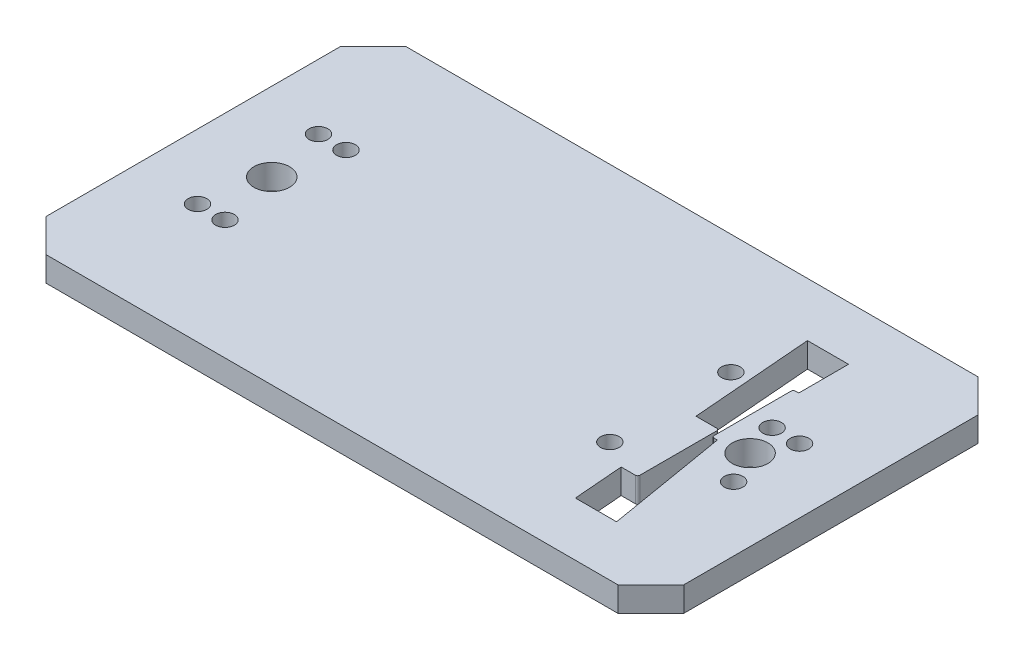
ISO-10303-21;
HEADER;
FILE_DESCRIPTION(('STEP AP214'),'2;1');
FILE_NAME('part.step','',(''),(''),'','','');
FILE_SCHEMA(('AUTOMOTIVE_DESIGN { 1 0 10303 214 1 1 1 1 }'));
ENDSEC;
DATA;
#1=APPLICATION_CONTEXT('core data for automotive mechanical design processes');
#2=APPLICATION_PROTOCOL_DEFINITION('international standard','automotive_design',2000,#1);
#3=PRODUCT_CONTEXT('',#1,'mechanical');
#4=PRODUCT('Part','Part','',(#3));
#5=PRODUCT_RELATED_PRODUCT_CATEGORY('part','',(#4));
#6=PRODUCT_DEFINITION_FORMATION('','',#4);
#7=PRODUCT_DEFINITION_CONTEXT('part definition',#1,'design');
#8=PRODUCT_DEFINITION('design','',#6,#7);
#9=PRODUCT_DEFINITION_SHAPE('','',#8);
#10=(LENGTH_UNIT() NAMED_UNIT(*) SI_UNIT(.MILLI.,.METRE.));
#11=(NAMED_UNIT(*) PLANE_ANGLE_UNIT() SI_UNIT($,.RADIAN.));
#12=(NAMED_UNIT(*) SI_UNIT($,.STERADIAN.) SOLID_ANGLE_UNIT());
#13=UNCERTAINTY_MEASURE_WITH_UNIT(LENGTH_MEASURE(1.E-05),#10,'distance_accuracy_value','');
#14=(GEOMETRIC_REPRESENTATION_CONTEXT(3) GLOBAL_UNCERTAINTY_ASSIGNED_CONTEXT((#13)) GLOBAL_UNIT_ASSIGNED_CONTEXT((#10,
#11,#12)) REPRESENTATION_CONTEXT('',''));
#15=CARTESIAN_POINT('',(0.,0.,0.));
#16=DIRECTION('',(0.,0.,1.));
#17=DIRECTION('',(1.,0.,0.));
#18=AXIS2_PLACEMENT_3D('',#15,#16,#17);
#19=CARTESIAN_POINT('',(0.,4.5,0.));
#20=DIRECTION('',(0.,1.,0.));
#21=DIRECTION('',(0.,0.,1.));
#22=AXIS2_PLACEMENT_3D('',#19,#20,#21);
#23=PLANE('',#22);
#24=CARTESIAN_POINT('',(51.3,4.5,-6.00000000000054));
#25=DIRECTION('',(0.,1.,0.));
#26=DIRECTION('',(0.,0.,1.));
#27=AXIS2_PLACEMENT_3D('',#24,#25,#26);
#28=CIRCLE('',#27,1.7);
#29=CARTESIAN_POINT('',(51.3,4.5,-4.30000000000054));
#30=VERTEX_POINT('',#29);
#31=EDGE_CURVE('E553',#30,#30,#28,.T.);
#32=ORIENTED_EDGE('',*,*,#31,.F.);
#33=EDGE_LOOP('',(#32));
#34=FACE_BOUND('',#33,.T.);
#35=CARTESIAN_POINT('',(33.8,4.5,10.9999999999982));
#36=DIRECTION('',(0.,1.,0.));
#37=DIRECTION('',(0.,0.,1.));
#38=AXIS2_PLACEMENT_3D('',#35,#36,#37);
#39=CIRCLE('',#38,1.7);
#40=CARTESIAN_POINT('',(33.8,4.5,12.6999999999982));
#41=VERTEX_POINT('',#40);
#42=EDGE_CURVE('E565',#41,#41,#39,.T.);
#43=ORIENTED_EDGE('',*,*,#42,.F.);
#44=EDGE_LOOP('',(#43));
#45=FACE_BOUND('',#44,.T.);
#46=CARTESIAN_POINT('',(-36.2,4.5,10.9999999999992));
#47=DIRECTION('',(0.,1.,0.));
#48=DIRECTION('',(0.,0.,1.));
#49=AXIS2_PLACEMENT_3D('',#46,#47,#48);
#50=CIRCLE('',#49,1.7);
#51=CARTESIAN_POINT('',(-36.2,4.5,12.6999999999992));
#52=VERTEX_POINT('',#51);
#53=EDGE_CURVE('E577',#52,#52,#50,.T.);
#54=ORIENTED_EDGE('',*,*,#53,.F.);
#55=EDGE_LOOP('',(#54));
#56=FACE_BOUND('',#55,.T.);
#57=CARTESIAN_POINT('',(-41.2,4.5,10.9999999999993));
#58=DIRECTION('',(0.,1.,0.));
#59=DIRECTION('',(0.,0.,1.));
#60=AXIS2_PLACEMENT_3D('',#57,#58,#59);
#61=CIRCLE('',#60,1.7);
#62=CARTESIAN_POINT('',(-41.2,4.5,12.6999999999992));
#63=VERTEX_POINT('',#62);
#64=EDGE_CURVE('E589',#63,#63,#61,.T.);
#65=ORIENTED_EDGE('',*,*,#64,.F.);
#66=EDGE_LOOP('',(#65));
#67=FACE_BOUND('',#66,.T.);
#68=CARTESIAN_POINT('',(48.3,4.5,0.));
#69=DIRECTION('',(0.,1.,0.));
#70=DIRECTION('',(0.,0.,1.));
#71=AXIS2_PLACEMENT_3D('',#68,#69,#70);
#72=CIRCLE('',#71,3.25);
#73=CARTESIAN_POINT('',(48.3,4.5,3.24999999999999));
#74=VERTEX_POINT('',#73);
#75=EDGE_CURVE('E601',#74,#74,#72,.T.);
#76=ORIENTED_EDGE('',*,*,#75,.F.);
#77=EDGE_LOOP('',(#76));
#78=FACE_BOUND('',#77,.T.);
#79=DIRECTION('',(-0.166195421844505,0.,-0.986092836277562));
#80=VECTOR('',#79,1.);
#81=CARTESIAN_POINT('',(43.25,4.5,0.899999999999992));
#82=LINE('',#81,#80);
#83=CARTESIAN_POINT('',(46.9662921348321,4.5,22.9500000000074));
#84=VERTEX_POINT('',#83);
#85=CARTESIAN_POINT('',(43.25,4.5,0.899999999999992));
#86=VERTEX_POINT('',#85);
#87=EDGE_CURVE('E202',#84,#86,#82,.T.);
#88=ORIENTED_EDGE('',*,*,#87,.F.);
#89=DIRECTION('',(1.,0.,0.));
#90=VECTOR('',#89,1.);
#91=CARTESIAN_POINT('',(46.9662921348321,4.5,22.9500000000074));
#92=LINE('',#91,#90);
#93=CARTESIAN_POINT('',(39.4842462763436,4.5,22.9500000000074));
#94=VERTEX_POINT('',#93);
#95=EDGE_CURVE('E194',#94,#84,#92,.T.);
#96=ORIENTED_EDGE('',*,*,#95,.F.);
#97=DIRECTION('',(0.0803714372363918,0.,0.996764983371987));
#98=VECTOR('',#97,1.);
#99=CARTESIAN_POINT('',(39.4842462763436,4.5,22.9500000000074));
#100=LINE('',#99,#98);
#101=CARTESIAN_POINT('',(38.7545241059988,4.5,13.9));
#102=VERTEX_POINT('',#101);
#103=EDGE_CURVE('E245',#102,#94,#100,.T.);
#104=ORIENTED_EDGE('',*,*,#103,.F.);
#105=DIRECTION('',(-1.,0.,0.));
#106=VECTOR('',#105,1.);
#107=CARTESIAN_POINT('',(38.7545241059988,4.5,13.9));
#108=LINE('',#107,#106);
#109=CARTESIAN_POINT('',(41.35,4.5,13.9));
#110=VERTEX_POINT('',#109);
#111=EDGE_CURVE('E243',#110,#102,#108,.T.);
#112=ORIENTED_EDGE('',*,*,#111,.F.);
#113=CARTESIAN_POINT('',(41.35,4.5,13.5));
#114=DIRECTION('',(0.,-1.,0.));
#115=DIRECTION('',(0.,0.,-1.));
#116=AXIS2_PLACEMENT_3D('',#113,#114,#115);
#117=CIRCLE('',#116,0.399999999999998);
#118=CARTESIAN_POINT('',(41.75,4.5,13.5));
#119=VERTEX_POINT('',#118);
#120=EDGE_CURVE('E241',#119,#110,#117,.T.);
#121=ORIENTED_EDGE('',*,*,#120,.F.);
#122=DIRECTION('',(0.,0.,1.));
#123=VECTOR('',#122,1.);
#124=CARTESIAN_POINT('',(41.75,4.5,13.5));
#125=LINE('',#124,#123);
#126=CARTESIAN_POINT('',(41.75,4.5,-0.500000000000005));
#127=VERTEX_POINT('',#126);
#128=EDGE_CURVE('E239',#127,#119,#125,.T.);
#129=ORIENTED_EDGE('',*,*,#128,.F.);
#130=CARTESIAN_POINT('',(41.35,4.5,-0.500000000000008));
#131=DIRECTION('',(0.,-1.,0.));
#132=DIRECTION('',(0.,0.,-1.));
#133=AXIS2_PLACEMENT_3D('',#130,#131,#132);
#134=CIRCLE('',#133,0.399999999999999);
#135=CARTESIAN_POINT('',(41.35,4.5,-0.900000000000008));
#136=VERTEX_POINT('',#135);
#137=EDGE_CURVE('E237',#136,#127,#134,.T.);
#138=ORIENTED_EDGE('',*,*,#137,.F.);
#139=DIRECTION('',(1.,0.,0.));
#140=VECTOR('',#139,1.);
#141=CARTESIAN_POINT('',(41.35,4.5,-0.900000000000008));
#142=LINE('',#141,#140);
#143=CARTESIAN_POINT('',(37.5611663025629,4.5,-0.900000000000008));
#144=VERTEX_POINT('',#143);
#145=EDGE_CURVE('E235',#144,#136,#142,.T.);
#146=ORIENTED_EDGE('',*,*,#145,.F.);
#147=DIRECTION('',(0.0803714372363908,0.,0.996764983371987));
#148=VECTOR('',#147,1.);
#149=CARTESIAN_POINT('',(37.5611663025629,4.5,-0.900000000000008));
#150=LINE('',#149,#148);
#151=CARTESIAN_POINT('',(35.7832244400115,4.5,-22.95));
#152=VERTEX_POINT('',#151);
#153=EDGE_CURVE('E233',#152,#144,#150,.T.);
#154=ORIENTED_EDGE('',*,*,#153,.F.);
#155=DIRECTION('',(-1.,0.,0.));
#156=VECTOR('',#155,1.);
#157=CARTESIAN_POINT('',(35.7832244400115,4.5,-22.95));
#158=LINE('',#157,#156);
#159=CARTESIAN_POINT('',(43.25,4.5,-22.95));
#160=VERTEX_POINT('',#159);
#161=EDGE_CURVE('E231',#160,#152,#158,.T.);
#162=ORIENTED_EDGE('',*,*,#161,.F.);
#163=DIRECTION('',(0.,0.,-1.));
#164=VECTOR('',#163,1.);
#165=CARTESIAN_POINT('',(43.25,4.5,-13.9));
#166=LINE('',#165,#164);
#167=CARTESIAN_POINT('',(43.25,4.5,-13.9));
#168=VERTEX_POINT('',#167);
#169=EDGE_CURVE('E229',#168,#160,#166,.T.);
#170=ORIENTED_EDGE('',*,*,#169,.F.);
#171=DIRECTION('',(1.,0.,0.));
#172=VECTOR('',#171,1.);
#173=CARTESIAN_POINT('',(42.65,4.5,-13.9));
#174=LINE('',#173,#172);
#175=CARTESIAN_POINT('',(42.65,4.5,-13.9));
#176=VERTEX_POINT('',#175);
#177=EDGE_CURVE('E227',#176,#168,#174,.T.);
#178=ORIENTED_EDGE('',*,*,#177,.F.);
#179=CARTESIAN_POINT('',(42.65,4.5,-13.5));
#180=DIRECTION('',(0.,-1.,0.));
#181=DIRECTION('',(0.,0.,1.));
#182=AXIS2_PLACEMENT_3D('',#179,#180,#181);
#183=CIRCLE('',#182,0.399999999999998);
#184=CARTESIAN_POINT('',(42.25,4.5,-13.5));
#185=VERTEX_POINT('',#184);
#186=EDGE_CURVE('E225',#185,#176,#183,.T.);
#187=ORIENTED_EDGE('',*,*,#186,.F.);
#188=DIRECTION('',(0.,0.,-1.));
#189=VECTOR('',#188,1.);
#190=CARTESIAN_POINT('',(42.25,4.5,0.499999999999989));
#191=LINE('',#190,#189);
#192=CARTESIAN_POINT('',(42.25,4.5,0.499999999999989));
#193=VERTEX_POINT('',#192);
#194=EDGE_CURVE('E223',#193,#185,#191,.T.);
#195=ORIENTED_EDGE('',*,*,#194,.F.);
#196=CARTESIAN_POINT('',(42.65,4.5,0.499999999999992));
#197=DIRECTION('',(0.,-1.,0.));
#198=DIRECTION('',(0.,0.,-1.));
#199=AXIS2_PLACEMENT_3D('',#196,#197,#198);
#200=CIRCLE('',#199,0.399999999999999);
#201=CARTESIAN_POINT('',(42.65,4.5,0.899999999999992));
#202=VERTEX_POINT('',#201);
#203=EDGE_CURVE('E218',#202,#193,#200,.T.);
#204=ORIENTED_EDGE('',*,*,#203,.F.);
#205=DIRECTION('',(-1.,0.,0.));
#206=VECTOR('',#205,1.);
#207=CARTESIAN_POINT('',(42.65,4.5,0.899999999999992));
#208=LINE('',#207,#206);
#209=EDGE_CURVE('E216',#86,#202,#208,.T.);
#210=ORIENTED_EDGE('',*,*,#209,.F.);
#211=EDGE_LOOP('',(#88,#96,#104,#112,#121,#129,#138,#146,#154,#162,#170,#178,#187,#195,#204,#210));
#212=FACE_BOUND('',#211,.T.);
#213=DIRECTION('',(0.,0.,1.));
#214=VECTOR('',#213,1.);
#215=CARTESIAN_POINT('',(-53.,4.5,-26.75));
#216=LINE('',#215,#214);
#217=CARTESIAN_POINT('',(-53.,4.5,-26.75));
#218=VERTEX_POINT('',#217);
#219=CARTESIAN_POINT('',(-53.,4.5,26.75));
#220=VERTEX_POINT('',#219);
#221=EDGE_CURVE('E318',#218,#220,#216,.T.);
#222=ORIENTED_EDGE('',*,*,#221,.T.);
#223=DIRECTION('',(0.707106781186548,0.,0.707106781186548));
#224=VECTOR('',#223,1.);
#225=CARTESIAN_POINT('',(-53.,4.5,26.75));
#226=LINE('',#225,#224);
#227=CARTESIAN_POINT('',(-47.,4.5,32.75));
#228=VERTEX_POINT('',#227);
#229=EDGE_CURVE('E321',#220,#228,#226,.T.);
#230=ORIENTED_EDGE('',*,*,#229,.T.);
#231=DIRECTION('',(1.,0.,0.));
#232=VECTOR('',#231,1.);
#233=CARTESIAN_POINT('',(-47.,4.5,32.75));
#234=LINE('',#233,#232);
#235=CARTESIAN_POINT('',(57.,4.5,32.75));
#236=VERTEX_POINT('',#235);
#237=EDGE_CURVE('E324',#228,#236,#234,.T.);
#238=ORIENTED_EDGE('',*,*,#237,.T.);
#239=DIRECTION('',(0.707106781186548,0.,-0.707106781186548));
#240=VECTOR('',#239,1.);
#241=CARTESIAN_POINT('',(57.,4.5,32.75));
#242=LINE('',#241,#240);
#243=CARTESIAN_POINT('',(63.,4.5,26.75));
#244=VERTEX_POINT('',#243);
#245=EDGE_CURVE('E326',#236,#244,#242,.T.);
#246=ORIENTED_EDGE('',*,*,#245,.T.);
#247=DIRECTION('',(0.,0.,-1.));
#248=VECTOR('',#247,1.);
#249=CARTESIAN_POINT('',(63.,4.5,26.75));
#250=LINE('',#249,#248);
#251=CARTESIAN_POINT('',(63.,4.5,-26.75));
#252=VERTEX_POINT('',#251);
#253=EDGE_CURVE('E328',#244,#252,#250,.T.);
#254=ORIENTED_EDGE('',*,*,#253,.T.);
#255=DIRECTION('',(-0.707106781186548,0.,-0.707106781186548));
#256=VECTOR('',#255,1.);
#257=CARTESIAN_POINT('',(63.,4.5,-26.75));
#258=LINE('',#257,#256);
#259=CARTESIAN_POINT('',(57.,4.5,-32.75));
#260=VERTEX_POINT('',#259);
#261=EDGE_CURVE('E330',#252,#260,#258,.T.);
#262=ORIENTED_EDGE('',*,*,#261,.T.);
#263=DIRECTION('',(-1.,0.,0.));
#264=VECTOR('',#263,1.);
#265=CARTESIAN_POINT('',(57.,4.5,-32.75));
#266=LINE('',#265,#264);
#267=CARTESIAN_POINT('',(-47.,4.5,-32.75));
#268=VERTEX_POINT('',#267);
#269=EDGE_CURVE('E332',#260,#268,#266,.T.);
#270=ORIENTED_EDGE('',*,*,#269,.T.);
#271=DIRECTION('',(-0.707106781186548,0.,0.707106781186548));
#272=VECTOR('',#271,1.);
#273=CARTESIAN_POINT('',(-47.,4.5,-32.75));
#274=LINE('',#273,#272);
#275=EDGE_CURVE('E334',#268,#218,#274,.T.);
#276=ORIENTED_EDGE('',*,*,#275,.T.);
#277=EDGE_LOOP('',(#222,#230,#238,#246,#254,#262,#270,#276));
#278=FACE_BOUND('',#277,.T.);
#279=CARTESIAN_POINT('',(-38.7,4.5,0.));
#280=DIRECTION('',(0.,1.,0.));
#281=DIRECTION('',(0.,0.,1.));
#282=AXIS2_PLACEMENT_3D('',#279,#280,#281);
#283=CIRCLE('',#282,3.25);
#284=CARTESIAN_POINT('',(-38.7,4.5,3.25));
#285=VERTEX_POINT('',#284);
#286=EDGE_CURVE('E248',#285,#285,#283,.T.);
#287=ORIENTED_EDGE('',*,*,#286,.F.);
#288=EDGE_LOOP('',(#287));
#289=FACE_BOUND('',#288,.T.);
#290=CARTESIAN_POINT('',(-41.2,4.5,-10.9999999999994));
#291=DIRECTION('',(0.,1.,0.));
#292=DIRECTION('',(0.,0.,1.));
#293=AXIS2_PLACEMENT_3D('',#290,#291,#292);
#294=CIRCLE('',#293,1.7);
#295=CARTESIAN_POINT('',(-41.2,4.5,-9.29999999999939));
#296=VERTEX_POINT('',#295);
#297=EDGE_CURVE('E595',#296,#296,#294,.T.);
#298=ORIENTED_EDGE('',*,*,#297,.F.);
#299=EDGE_LOOP('',(#298));
#300=FACE_BOUND('',#299,.T.);
#301=CARTESIAN_POINT('',(-36.2,4.5,-10.9999999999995));
#302=DIRECTION('',(0.,1.,0.));
#303=DIRECTION('',(0.,0.,1.));
#304=AXIS2_PLACEMENT_3D('',#301,#302,#303);
#305=CIRCLE('',#304,1.7);
#306=CARTESIAN_POINT('',(-36.2,4.5,-9.29999999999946));
#307=VERTEX_POINT('',#306);
#308=EDGE_CURVE('E583',#307,#307,#305,.T.);
#309=ORIENTED_EDGE('',*,*,#308,.F.);
#310=EDGE_LOOP('',(#309));
#311=FACE_BOUND('',#310,.T.);
#312=CARTESIAN_POINT('',(33.8,4.5,-11.0000000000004));
#313=DIRECTION('',(0.,1.,0.));
#314=DIRECTION('',(0.,0.,1.));
#315=AXIS2_PLACEMENT_3D('',#312,#313,#314);
#316=CIRCLE('',#315,1.7);
#317=CARTESIAN_POINT('',(33.8,4.5,-9.30000000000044));
#318=VERTEX_POINT('',#317);
#319=EDGE_CURVE('E571',#318,#318,#316,.T.);
#320=ORIENTED_EDGE('',*,*,#319,.F.);
#321=EDGE_LOOP('',(#320));
#322=FACE_BOUND('',#321,.T.);
#323=CARTESIAN_POINT('',(46.3,4.5,-6.00000000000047));
#324=DIRECTION('',(0.,1.,0.));
#325=DIRECTION('',(0.,0.,1.));
#326=AXIS2_PLACEMENT_3D('',#323,#324,#325);
#327=CIRCLE('',#326,1.7);
#328=CARTESIAN_POINT('',(46.3,4.5,-4.30000000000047));
#329=VERTEX_POINT('',#328);
#330=EDGE_CURVE('E559',#329,#329,#327,.T.);
#331=ORIENTED_EDGE('',*,*,#330,.F.);
#332=EDGE_LOOP('',(#331));
#333=FACE_BOUND('',#332,.T.);
#334=CARTESIAN_POINT('',(51.3,4.5,5.99999999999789));
#335=DIRECTION('',(0.,1.,0.));
#336=DIRECTION('',(0.,0.,1.));
#337=AXIS2_PLACEMENT_3D('',#334,#335,#336);
#338=CIRCLE('',#337,1.7);
#339=CARTESIAN_POINT('',(51.3,4.5,7.69999999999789));
#340=VERTEX_POINT('',#339);
#341=EDGE_CURVE('E544',#340,#340,#338,.T.);
#342=ORIENTED_EDGE('',*,*,#341,.F.);
#343=EDGE_LOOP('',(#342));
#344=FACE_BOUND('',#343,.T.);
#345=ADVANCED_FACE('F33',(#34,#45,#56,#67,#78,#212,#278,#289,#300,#311,#322,#333,#344),#23,.T.);
#346=CARTESIAN_POINT('',(0.,0.,0.));
#347=DIRECTION('',(0.,1.,0.));
#348=DIRECTION('',(0.,0.,1.));
#349=AXIS2_PLACEMENT_3D('',#346,#347,#348);
#350=PLANE('',#349);
#351=CARTESIAN_POINT('',(51.3,0.,-6.00000000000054));
#352=DIRECTION('',(0.,1.,0.));
#353=DIRECTION('',(0.,0.,1.));
#354=AXIS2_PLACEMENT_3D('',#351,#352,#353);
#355=CIRCLE('',#354,1.7);
#356=CARTESIAN_POINT('',(51.3,0.,-4.30000000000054));
#357=VERTEX_POINT('',#356);
#358=EDGE_CURVE('E550',#357,#357,#355,.T.);
#359=ORIENTED_EDGE('',*,*,#358,.T.);
#360=EDGE_LOOP('',(#359));
#361=FACE_BOUND('',#360,.T.);
#362=CARTESIAN_POINT('',(33.8,0.,10.9999999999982));
#363=DIRECTION('',(0.,1.,0.));
#364=DIRECTION('',(0.,0.,1.));
#365=AXIS2_PLACEMENT_3D('',#362,#363,#364);
#366=CIRCLE('',#365,1.7);
#367=CARTESIAN_POINT('',(33.8,0.,12.6999999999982));
#368=VERTEX_POINT('',#367);
#369=EDGE_CURVE('E562',#368,#368,#366,.T.);
#370=ORIENTED_EDGE('',*,*,#369,.T.);
#371=EDGE_LOOP('',(#370));
#372=FACE_BOUND('',#371,.T.);
#373=CARTESIAN_POINT('',(-36.2,0.,10.9999999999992));
#374=DIRECTION('',(0.,1.,0.));
#375=DIRECTION('',(0.,0.,1.));
#376=AXIS2_PLACEMENT_3D('',#373,#374,#375);
#377=CIRCLE('',#376,1.7);
#378=CARTESIAN_POINT('',(-36.2,0.,12.6999999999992));
#379=VERTEX_POINT('',#378);
#380=EDGE_CURVE('E574',#379,#379,#377,.T.);
#381=ORIENTED_EDGE('',*,*,#380,.T.);
#382=EDGE_LOOP('',(#381));
#383=FACE_BOUND('',#382,.T.);
#384=CARTESIAN_POINT('',(-41.2,0.,10.9999999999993));
#385=DIRECTION('',(0.,1.,0.));
#386=DIRECTION('',(0.,0.,1.));
#387=AXIS2_PLACEMENT_3D('',#384,#385,#386);
#388=CIRCLE('',#387,1.7);
#389=CARTESIAN_POINT('',(-41.2,0.,12.6999999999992));
#390=VERTEX_POINT('',#389);
#391=EDGE_CURVE('E586',#390,#390,#388,.T.);
#392=ORIENTED_EDGE('',*,*,#391,.T.);
#393=EDGE_LOOP('',(#392));
#394=FACE_BOUND('',#393,.T.);
#395=CARTESIAN_POINT('',(48.3,0.,0.));
#396=DIRECTION('',(0.,1.,0.));
#397=DIRECTION('',(0.,0.,1.));
#398=AXIS2_PLACEMENT_3D('',#395,#396,#397);
#399=CIRCLE('',#398,3.25);
#400=CARTESIAN_POINT('',(48.3,0.,3.24999999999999));
#401=VERTEX_POINT('',#400);
#402=EDGE_CURVE('E598',#401,#401,#399,.T.);
#403=ORIENTED_EDGE('',*,*,#402,.T.);
#404=EDGE_LOOP('',(#403));
#405=FACE_BOUND('',#404,.T.);
#406=DIRECTION('',(1.,0.,0.));
#407=VECTOR('',#406,1.);
#408=CARTESIAN_POINT('',(46.9662921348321,0.,22.9500000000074));
#409=LINE('',#408,#407);
#410=CARTESIAN_POINT('',(39.4842462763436,0.,22.9500000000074));
#411=VERTEX_POINT('',#410);
#412=CARTESIAN_POINT('',(46.9662921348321,0.,22.9500000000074));
#413=VERTEX_POINT('',#412);
#414=EDGE_CURVE('E56',#411,#413,#409,.T.);
#415=ORIENTED_EDGE('',*,*,#414,.T.);
#416=DIRECTION('',(-0.166195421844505,0.,-0.986092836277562));
#417=VECTOR('',#416,1.);
#418=CARTESIAN_POINT('',(43.25,0.,0.899999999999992));
#419=LINE('',#418,#417);
#420=CARTESIAN_POINT('',(43.25,0.,0.899999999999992));
#421=VERTEX_POINT('',#420);
#422=EDGE_CURVE('E209',#413,#421,#419,.T.);
#423=ORIENTED_EDGE('',*,*,#422,.T.);
#424=DIRECTION('',(-1.,0.,0.));
#425=VECTOR('',#424,1.);
#426=CARTESIAN_POINT('',(42.65,0.,0.899999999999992));
#427=LINE('',#426,#425);
#428=CARTESIAN_POINT('',(42.65,0.,0.899999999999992));
#429=VERTEX_POINT('',#428);
#430=EDGE_CURVE('E250',#421,#429,#427,.T.);
#431=ORIENTED_EDGE('',*,*,#430,.T.);
#432=CARTESIAN_POINT('',(42.65,0.,0.499999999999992));
#433=DIRECTION('',(0.,-1.,0.));
#434=DIRECTION('',(0.,0.,-1.));
#435=AXIS2_PLACEMENT_3D('',#432,#433,#434);
#436=CIRCLE('',#435,0.399999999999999);
#437=CARTESIAN_POINT('',(42.25,0.,0.499999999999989));
#438=VERTEX_POINT('',#437);
#439=EDGE_CURVE('E253',#429,#438,#436,.T.);
#440=ORIENTED_EDGE('',*,*,#439,.T.);
#441=DIRECTION('',(0.,0.,-1.));
#442=VECTOR('',#441,1.);
#443=CARTESIAN_POINT('',(42.25,0.,0.499999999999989));
#444=LINE('',#443,#442);
#445=CARTESIAN_POINT('',(42.25,0.,-13.5));
#446=VERTEX_POINT('',#445);
#447=EDGE_CURVE('E256',#438,#446,#444,.T.);
#448=ORIENTED_EDGE('',*,*,#447,.T.);
#449=CARTESIAN_POINT('',(42.65,0.,-13.5));
#450=DIRECTION('',(0.,-1.,0.));
#451=DIRECTION('',(0.,0.,1.));
#452=AXIS2_PLACEMENT_3D('',#449,#450,#451);
#453=CIRCLE('',#452,0.399999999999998);
#454=CARTESIAN_POINT('',(42.65,0.,-13.9));
#455=VERTEX_POINT('',#454);
#456=EDGE_CURVE('E259',#446,#455,#453,.T.);
#457=ORIENTED_EDGE('',*,*,#456,.T.);
#458=DIRECTION('',(1.,0.,0.));
#459=VECTOR('',#458,1.);
#460=CARTESIAN_POINT('',(42.65,0.,-13.9));
#461=LINE('',#460,#459);
#462=CARTESIAN_POINT('',(43.25,0.,-13.9));
#463=VERTEX_POINT('',#462);
#464=EDGE_CURVE('E262',#455,#463,#461,.T.);
#465=ORIENTED_EDGE('',*,*,#464,.T.);
#466=DIRECTION('',(0.,0.,-1.));
#467=VECTOR('',#466,1.);
#468=CARTESIAN_POINT('',(43.25,0.,-13.9));
#469=LINE('',#468,#467);
#470=CARTESIAN_POINT('',(43.25,0.,-22.95));
#471=VERTEX_POINT('',#470);
#472=EDGE_CURVE('E265',#463,#471,#469,.T.);
#473=ORIENTED_EDGE('',*,*,#472,.T.);
#474=DIRECTION('',(-1.,0.,0.));
#475=VECTOR('',#474,1.);
#476=CARTESIAN_POINT('',(35.7832244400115,0.,-22.95));
#477=LINE('',#476,#475);
#478=CARTESIAN_POINT('',(35.7832244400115,0.,-22.95));
#479=VERTEX_POINT('',#478);
#480=EDGE_CURVE('E268',#471,#479,#477,.T.);
#481=ORIENTED_EDGE('',*,*,#480,.T.);
#482=DIRECTION('',(0.0803714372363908,0.,0.996764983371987));
#483=VECTOR('',#482,1.);
#484=CARTESIAN_POINT('',(37.5611663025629,0.,-0.900000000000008));
#485=LINE('',#484,#483);
#486=CARTESIAN_POINT('',(37.5611663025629,0.,-0.900000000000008));
#487=VERTEX_POINT('',#486);
#488=EDGE_CURVE('E271',#479,#487,#485,.T.);
#489=ORIENTED_EDGE('',*,*,#488,.T.);
#490=DIRECTION('',(1.,0.,0.));
#491=VECTOR('',#490,1.);
#492=CARTESIAN_POINT('',(41.35,0.,-0.900000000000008));
#493=LINE('',#492,#491);
#494=CARTESIAN_POINT('',(41.35,0.,-0.900000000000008));
#495=VERTEX_POINT('',#494);
#496=EDGE_CURVE('E274',#487,#495,#493,.T.);
#497=ORIENTED_EDGE('',*,*,#496,.T.);
#498=CARTESIAN_POINT('',(41.35,0.,-0.500000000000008));
#499=DIRECTION('',(0.,-1.,0.));
#500=DIRECTION('',(0.,0.,-1.));
#501=AXIS2_PLACEMENT_3D('',#498,#499,#500);
#502=CIRCLE('',#501,0.399999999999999);
#503=CARTESIAN_POINT('',(41.75,0.,-0.500000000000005));
#504=VERTEX_POINT('',#503);
#505=EDGE_CURVE('E277',#495,#504,#502,.T.);
#506=ORIENTED_EDGE('',*,*,#505,.T.);
#507=DIRECTION('',(0.,0.,1.));
#508=VECTOR('',#507,1.);
#509=CARTESIAN_POINT('',(41.75,0.,13.5));
#510=LINE('',#509,#508);
#511=CARTESIAN_POINT('',(41.75,0.,13.5));
#512=VERTEX_POINT('',#511);
#513=EDGE_CURVE('E280',#504,#512,#510,.T.);
#514=ORIENTED_EDGE('',*,*,#513,.T.);
#515=CARTESIAN_POINT('',(41.35,0.,13.5));
#516=DIRECTION('',(0.,-1.,0.));
#517=DIRECTION('',(0.,0.,-1.));
#518=AXIS2_PLACEMENT_3D('',#515,#516,#517);
#519=CIRCLE('',#518,0.399999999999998);
#520=CARTESIAN_POINT('',(41.35,0.,13.9));
#521=VERTEX_POINT('',#520);
#522=EDGE_CURVE('E283',#512,#521,#519,.T.);
#523=ORIENTED_EDGE('',*,*,#522,.T.);
#524=DIRECTION('',(-1.,0.,0.));
#525=VECTOR('',#524,1.);
#526=CARTESIAN_POINT('',(38.7545241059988,0.,13.9));
#527=LINE('',#526,#525);
#528=CARTESIAN_POINT('',(38.7545241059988,0.,13.9));
#529=VERTEX_POINT('',#528);
#530=EDGE_CURVE('E286',#521,#529,#527,.T.);
#531=ORIENTED_EDGE('',*,*,#530,.T.);
#532=DIRECTION('',(0.0803714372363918,0.,0.996764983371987));
#533=VECTOR('',#532,1.);
#534=CARTESIAN_POINT('',(39.4842462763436,0.,22.9500000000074));
#535=LINE('',#534,#533);
#536=EDGE_CURVE('E203',#529,#411,#535,.T.);
#537=ORIENTED_EDGE('',*,*,#536,.T.);
#538=EDGE_LOOP('',(#415,#423,#431,#440,#448,#457,#465,#473,#481,#489,#497,#506,#514,#523,#531,#537));
#539=FACE_BOUND('',#538,.T.);
#540=DIRECTION('',(0.,0.,1.));
#541=VECTOR('',#540,1.);
#542=CARTESIAN_POINT('',(-53.,0.,-26.75));
#543=LINE('',#542,#541);
#544=CARTESIAN_POINT('',(-53.,0.,-26.75));
#545=VERTEX_POINT('',#544);
#546=CARTESIAN_POINT('',(-53.,0.,26.75));
#547=VERTEX_POINT('',#546);
#548=EDGE_CURVE('E210',#545,#547,#543,.T.);
#549=ORIENTED_EDGE('',*,*,#548,.F.);
#550=DIRECTION('',(-0.707106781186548,0.,0.707106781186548));
#551=VECTOR('',#550,1.);
#552=CARTESIAN_POINT('',(-47.,0.,-32.75));
#553=LINE('',#552,#551);
#554=CARTESIAN_POINT('',(-47.,0.,-32.75));
#555=VERTEX_POINT('',#554);
#556=EDGE_CURVE('E322',#555,#545,#553,.T.);
#557=ORIENTED_EDGE('',*,*,#556,.F.);
#558=DIRECTION('',(-1.,0.,0.));
#559=VECTOR('',#558,1.);
#560=CARTESIAN_POINT('',(57.,0.,-32.75));
#561=LINE('',#560,#559);
#562=CARTESIAN_POINT('',(57.,0.,-32.75));
#563=VERTEX_POINT('',#562);
#564=EDGE_CURVE('E349',#563,#555,#561,.T.);
#565=ORIENTED_EDGE('',*,*,#564,.F.);
#566=DIRECTION('',(-0.707106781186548,0.,-0.707106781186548));
#567=VECTOR('',#566,1.);
#568=CARTESIAN_POINT('',(63.,0.,-26.75));
#569=LINE('',#568,#567);
#570=CARTESIAN_POINT('',(63.,0.,-26.75));
#571=VERTEX_POINT('',#570);
#572=EDGE_CURVE('E347',#571,#563,#569,.T.);
#573=ORIENTED_EDGE('',*,*,#572,.F.);
#574=DIRECTION('',(0.,0.,-1.));
#575=VECTOR('',#574,1.);
#576=CARTESIAN_POINT('',(63.,0.,26.75));
#577=LINE('',#576,#575);
#578=CARTESIAN_POINT('',(63.,0.,26.75));
#579=VERTEX_POINT('',#578);
#580=EDGE_CURVE('E345',#579,#571,#577,.T.);
#581=ORIENTED_EDGE('',*,*,#580,.F.);
#582=DIRECTION('',(0.707106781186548,0.,-0.707106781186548));
#583=VECTOR('',#582,1.);
#584=CARTESIAN_POINT('',(57.,0.,32.75));
#585=LINE('',#584,#583);
#586=CARTESIAN_POINT('',(57.,0.,32.75));
#587=VERTEX_POINT('',#586);
#588=EDGE_CURVE('E343',#587,#579,#585,.T.);
#589=ORIENTED_EDGE('',*,*,#588,.F.);
#590=DIRECTION('',(1.,0.,0.));
#591=VECTOR('',#590,1.);
#592=CARTESIAN_POINT('',(-47.,0.,32.75));
#593=LINE('',#592,#591);
#594=CARTESIAN_POINT('',(-47.,0.,32.75));
#595=VERTEX_POINT('',#594);
#596=EDGE_CURVE('E341',#595,#587,#593,.T.);
#597=ORIENTED_EDGE('',*,*,#596,.F.);
#598=DIRECTION('',(0.707106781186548,0.,0.707106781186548));
#599=VECTOR('',#598,1.);
#600=CARTESIAN_POINT('',(-53.,0.,26.75));
#601=LINE('',#600,#599);
#602=EDGE_CURVE('E339',#547,#595,#601,.T.);
#603=ORIENTED_EDGE('',*,*,#602,.F.);
#604=EDGE_LOOP('',(#549,#557,#565,#573,#581,#589,#597,#603));
#605=FACE_BOUND('',#604,.T.);
#606=CARTESIAN_POINT('',(-38.7,0.,0.));
#607=DIRECTION('',(0.,1.,0.));
#608=DIRECTION('',(0.,0.,1.));
#609=AXIS2_PLACEMENT_3D('',#606,#607,#608);
#610=CIRCLE('',#609,3.25);
#611=CARTESIAN_POINT('',(-38.7,0.,3.25));
#612=VERTEX_POINT('',#611);
#613=EDGE_CURVE('E604',#612,#612,#610,.T.);
#614=ORIENTED_EDGE('',*,*,#613,.T.);
#615=EDGE_LOOP('',(#614));
#616=FACE_BOUND('',#615,.T.);
#617=CARTESIAN_POINT('',(-41.2,0.,-10.9999999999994));
#618=DIRECTION('',(0.,1.,0.));
#619=DIRECTION('',(0.,0.,1.));
#620=AXIS2_PLACEMENT_3D('',#617,#618,#619);
#621=CIRCLE('',#620,1.7);
#622=CARTESIAN_POINT('',(-41.2,0.,-9.29999999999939));
#623=VERTEX_POINT('',#622);
#624=EDGE_CURVE('E592',#623,#623,#621,.T.);
#625=ORIENTED_EDGE('',*,*,#624,.T.);
#626=EDGE_LOOP('',(#625));
#627=FACE_BOUND('',#626,.T.);
#628=CARTESIAN_POINT('',(-36.2,0.,-10.9999999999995));
#629=DIRECTION('',(0.,1.,0.));
#630=DIRECTION('',(0.,0.,1.));
#631=AXIS2_PLACEMENT_3D('',#628,#629,#630);
#632=CIRCLE('',#631,1.7);
#633=CARTESIAN_POINT('',(-36.2,0.,-9.29999999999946));
#634=VERTEX_POINT('',#633);
#635=EDGE_CURVE('E580',#634,#634,#632,.T.);
#636=ORIENTED_EDGE('',*,*,#635,.T.);
#637=EDGE_LOOP('',(#636));
#638=FACE_BOUND('',#637,.T.);
#639=CARTESIAN_POINT('',(33.8,0.,-11.0000000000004));
#640=DIRECTION('',(0.,1.,0.));
#641=DIRECTION('',(0.,0.,1.));
#642=AXIS2_PLACEMENT_3D('',#639,#640,#641);
#643=CIRCLE('',#642,1.7);
#644=CARTESIAN_POINT('',(33.8,0.,-9.30000000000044));
#645=VERTEX_POINT('',#644);
#646=EDGE_CURVE('E568',#645,#645,#643,.T.);
#647=ORIENTED_EDGE('',*,*,#646,.T.);
#648=EDGE_LOOP('',(#647));
#649=FACE_BOUND('',#648,.T.);
#650=CARTESIAN_POINT('',(46.3,0.,-6.00000000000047));
#651=DIRECTION('',(0.,1.,0.));
#652=DIRECTION('',(0.,0.,1.));
#653=AXIS2_PLACEMENT_3D('',#650,#651,#652);
#654=CIRCLE('',#653,1.7);
#655=CARTESIAN_POINT('',(46.3,0.,-4.30000000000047));
#656=VERTEX_POINT('',#655);
#657=EDGE_CURVE('E556',#656,#656,#654,.T.);
#658=ORIENTED_EDGE('',*,*,#657,.T.);
#659=EDGE_LOOP('',(#658));
#660=FACE_BOUND('',#659,.T.);
#661=CARTESIAN_POINT('',(51.3,0.,5.99999999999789));
#662=DIRECTION('',(0.,1.,0.));
#663=DIRECTION('',(0.,0.,1.));
#664=AXIS2_PLACEMENT_3D('',#661,#662,#663);
#665=CIRCLE('',#664,1.7);
#666=CARTESIAN_POINT('',(51.3,0.,7.69999999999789));
#667=VERTEX_POINT('',#666);
#668=EDGE_CURVE('E547',#667,#667,#665,.T.);
#669=ORIENTED_EDGE('',*,*,#668,.T.);
#670=EDGE_LOOP('',(#669));
#671=FACE_BOUND('',#670,.T.);
#672=ADVANCED_FACE('F379',(#361,#372,#383,#394,#405,#539,#605,#616,#627,#638,#649,#660,#671),
#350,.F.);
#673=CARTESIAN_POINT('',(-53.,4.5,-26.75));
#674=DIRECTION('',(1.,0.,0.));
#675=DIRECTION('',(0.,0.,-1.));
#676=AXIS2_PLACEMENT_3D('',#673,#674,#675);
#677=PLANE('',#676);
#678=ORIENTED_EDGE('',*,*,#548,.T.);
#679=DIRECTION('',(0.,-1.,0.));
#680=VECTOR('',#679,1.);
#681=CARTESIAN_POINT('',(-53.,4.5,26.75));
#682=LINE('',#681,#680);
#683=EDGE_CURVE('E11',#220,#547,#682,.T.);
#684=ORIENTED_EDGE('',*,*,#683,.F.);
#685=ORIENTED_EDGE('',*,*,#221,.F.);
#686=DIRECTION('',(0.,-1.,0.));
#687=VECTOR('',#686,1.);
#688=CARTESIAN_POINT('',(-53.,4.5,-26.75));
#689=LINE('',#688,#687);
#690=EDGE_CURVE('E336',#218,#545,#689,.T.);
#691=ORIENTED_EDGE('',*,*,#690,.T.);
#692=EDGE_LOOP('',(#678,#684,#685,#691));
#693=FACE_BOUND('',#692,.T.);
#694=ADVANCED_FACE('F35',(#693),#677,.F.);
#695=CARTESIAN_POINT('',(-53.,4.5,26.75));
#696=DIRECTION('',(0.707106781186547,0.,-0.707106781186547));
#697=DIRECTION('',(-0.707106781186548,0.,-0.707106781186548));
#698=AXIS2_PLACEMENT_3D('',#695,#696,#697);
#699=PLANE('',#698);
#700=ORIENTED_EDGE('',*,*,#602,.T.);
#701=DIRECTION('',(0.,-1.,0.));
#702=VECTOR('',#701,1.);
#703=CARTESIAN_POINT('',(-47.,4.5,32.75));
#704=LINE('',#703,#702);
#705=EDGE_CURVE('E41',#228,#595,#704,.T.);
#706=ORIENTED_EDGE('',*,*,#705,.F.);
#707=ORIENTED_EDGE('',*,*,#229,.F.);
#708=ORIENTED_EDGE('',*,*,#683,.T.);
#709=EDGE_LOOP('',(#700,#706,#707,#708));
#710=FACE_BOUND('',#709,.T.);
#711=ADVANCED_FACE('F396',(#710),#699,.F.);
#712=CARTESIAN_POINT('',(-47.,4.5,32.75));
#713=DIRECTION('',(0.,0.,-1.));
#714=DIRECTION('',(-1.,0.,0.));
#715=AXIS2_PLACEMENT_3D('',#712,#713,#714);
#716=PLANE('',#715);
#717=ORIENTED_EDGE('',*,*,#596,.T.);
#718=DIRECTION('',(0.,-1.,0.));
#719=VECTOR('',#718,1.);
#720=CARTESIAN_POINT('',(57.,4.5,32.75));
#721=LINE('',#720,#719);
#722=EDGE_CURVE('E366',#236,#587,#721,.T.);
#723=ORIENTED_EDGE('',*,*,#722,.F.);
#724=ORIENTED_EDGE('',*,*,#237,.F.);
#725=ORIENTED_EDGE('',*,*,#705,.T.);
#726=EDGE_LOOP('',(#717,#723,#724,#725));
#727=FACE_BOUND('',#726,.T.);
#728=ADVANCED_FACE('F373',(#727),#716,.F.);
#729=CARTESIAN_POINT('',(57.,4.5,32.75));
#730=DIRECTION('',(-0.707106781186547,0.,-0.707106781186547));
#731=DIRECTION('',(-0.707106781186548,0.,0.707106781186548));
#732=AXIS2_PLACEMENT_3D('',#729,#730,#731);
#733=PLANE('',#732);
#734=ORIENTED_EDGE('',*,*,#588,.T.);
#735=DIRECTION('',(0.,-1.,0.));
#736=VECTOR('',#735,1.);
#737=CARTESIAN_POINT('',(63.,4.5,26.75));
#738=LINE('',#737,#736);
#739=EDGE_CURVE('E363',#244,#579,#738,.T.);
#740=ORIENTED_EDGE('',*,*,#739,.F.);
#741=ORIENTED_EDGE('',*,*,#245,.F.);
#742=ORIENTED_EDGE('',*,*,#722,.T.);
#743=EDGE_LOOP('',(#734,#740,#741,#742));
#744=FACE_BOUND('',#743,.T.);
#745=ADVANCED_FACE('F385',(#744),#733,.F.);
#746=CARTESIAN_POINT('',(63.,4.5,26.75));
#747=DIRECTION('',(-1.,0.,0.));
#748=DIRECTION('',(0.,0.,1.));
#749=AXIS2_PLACEMENT_3D('',#746,#747,#748);
#750=PLANE('',#749);
#751=ORIENTED_EDGE('',*,*,#580,.T.);
#752=DIRECTION('',(0.,-1.,0.));
#753=VECTOR('',#752,1.);
#754=CARTESIAN_POINT('',(63.,4.5,-26.75));
#755=LINE('',#754,#753);
#756=EDGE_CURVE('E360',#252,#571,#755,.T.);
#757=ORIENTED_EDGE('',*,*,#756,.F.);
#758=ORIENTED_EDGE('',*,*,#253,.F.);
#759=ORIENTED_EDGE('',*,*,#739,.T.);
#760=EDGE_LOOP('',(#751,#757,#758,#759));
#761=FACE_BOUND('',#760,.T.);
#762=ADVANCED_FACE('F389',(#761),#750,.F.);
#763=CARTESIAN_POINT('',(63.,4.5,-26.75));
#764=DIRECTION('',(-0.707106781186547,0.,0.707106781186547));
#765=DIRECTION('',(0.707106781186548,0.,0.707106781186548));
#766=AXIS2_PLACEMENT_3D('',#763,#764,#765);
#767=PLANE('',#766);
#768=ORIENTED_EDGE('',*,*,#572,.T.);
#769=DIRECTION('',(0.,-1.,0.));
#770=VECTOR('',#769,1.);
#771=CARTESIAN_POINT('',(57.,4.5,-32.75));
#772=LINE('',#771,#770);
#773=EDGE_CURVE('E357',#260,#563,#772,.T.);
#774=ORIENTED_EDGE('',*,*,#773,.F.);
#775=ORIENTED_EDGE('',*,*,#261,.F.);
#776=ORIENTED_EDGE('',*,*,#756,.T.);
#777=EDGE_LOOP('',(#768,#774,#775,#776));
#778=FACE_BOUND('',#777,.T.);
#779=ADVANCED_FACE('F409',(#778),#767,.F.);
#780=CARTESIAN_POINT('',(57.,4.5,-32.75));
#781=DIRECTION('',(0.,0.,1.));
#782=DIRECTION('',(1.,0.,0.));
#783=AXIS2_PLACEMENT_3D('',#780,#781,#782);
#784=PLANE('',#783);
#785=ORIENTED_EDGE('',*,*,#564,.T.);
#786=DIRECTION('',(0.,-1.,0.));
#787=VECTOR('',#786,1.);
#788=CARTESIAN_POINT('',(-47.,4.5,-32.75));
#789=LINE('',#788,#787);
#790=EDGE_CURVE('E354',#268,#555,#789,.T.);
#791=ORIENTED_EDGE('',*,*,#790,.F.);
#792=ORIENTED_EDGE('',*,*,#269,.F.);
#793=ORIENTED_EDGE('',*,*,#773,.T.);
#794=EDGE_LOOP('',(#785,#791,#792,#793));
#795=FACE_BOUND('',#794,.T.);
#796=ADVANCED_FACE('F407',(#795),#784,.F.);
#797=CARTESIAN_POINT('',(-47.,4.5,-32.75));
#798=DIRECTION('',(0.707106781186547,0.,0.707106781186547));
#799=DIRECTION('',(0.707106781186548,0.,-0.707106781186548));
#800=AXIS2_PLACEMENT_3D('',#797,#798,#799);
#801=PLANE('',#800);
#802=ORIENTED_EDGE('',*,*,#556,.T.);
#803=ORIENTED_EDGE('',*,*,#690,.F.);
#804=ORIENTED_EDGE('',*,*,#275,.F.);
#805=ORIENTED_EDGE('',*,*,#790,.T.);
#806=EDGE_LOOP('',(#802,#803,#804,#805));
#807=FACE_BOUND('',#806,.T.);
#808=ADVANCED_FACE('F402',(#807),#801,.F.);
#809=CARTESIAN_POINT('',(46.9662921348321,4.5,22.9500000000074));
#810=DIRECTION('',(0.,0.,-1.));
#811=DIRECTION('',(-1.,0.,0.));
#812=AXIS2_PLACEMENT_3D('',#809,#810,#811);
#813=PLANE('',#812);
#814=ORIENTED_EDGE('',*,*,#414,.F.);
#815=DIRECTION('',(0.,-1.,0.));
#816=VECTOR('',#815,1.);
#817=CARTESIAN_POINT('',(39.4842462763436,4.5,22.9500000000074));
#818=LINE('',#817,#816);
#819=EDGE_CURVE('E198',#94,#411,#818,.T.);
#820=ORIENTED_EDGE('',*,*,#819,.F.);
#821=ORIENTED_EDGE('',*,*,#95,.T.);
#822=DIRECTION('',(0.,-1.,0.));
#823=VECTOR('',#822,1.);
#824=CARTESIAN_POINT('',(46.9662921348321,4.5,22.9500000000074));
#825=LINE('',#824,#823);
#826=EDGE_CURVE('E197',#84,#413,#825,.T.);
#827=ORIENTED_EDGE('',*,*,#826,.T.);
#828=EDGE_LOOP('',(#814,#820,#821,#827));
#829=FACE_BOUND('',#828,.T.);
#830=ADVANCED_FACE('F196',(#829),#813,.T.);
#831=CARTESIAN_POINT('',(43.25,4.5,0.899999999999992));
#832=DIRECTION('',(-0.986092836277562,0.,0.166195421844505));
#833=DIRECTION('',(0.166195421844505,0.,0.986092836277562));
#834=AXIS2_PLACEMENT_3D('',#831,#832,#833);
#835=PLANE('',#834);
#836=ORIENTED_EDGE('',*,*,#422,.F.);
#837=ORIENTED_EDGE('',*,*,#826,.F.);
#838=ORIENTED_EDGE('',*,*,#87,.T.);
#839=DIRECTION('',(0.,-1.,0.));
#840=VECTOR('',#839,1.);
#841=CARTESIAN_POINT('',(43.25,4.5,0.899999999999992));
#842=LINE('',#841,#840);
#843=EDGE_CURVE('E211',#86,#421,#842,.T.);
#844=ORIENTED_EDGE('',*,*,#843,.T.);
#845=EDGE_LOOP('',(#836,#837,#838,#844));
#846=FACE_BOUND('',#845,.T.);
#847=ADVANCED_FACE('F206',(#846),#835,.T.);
#848=CARTESIAN_POINT('',(42.65,4.5,0.899999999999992));
#849=DIRECTION('',(0.,0.,1.));
#850=DIRECTION('',(1.,0.,0.));
#851=AXIS2_PLACEMENT_3D('',#848,#849,#850);
#852=PLANE('',#851);
#853=ORIENTED_EDGE('',*,*,#430,.F.);
#854=ORIENTED_EDGE('',*,*,#843,.F.);
#855=ORIENTED_EDGE('',*,*,#209,.T.);
#856=DIRECTION('',(0.,-1.,0.));
#857=VECTOR('',#856,1.);
#858=CARTESIAN_POINT('',(42.65,4.5,0.899999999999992));
#859=LINE('',#858,#857);
#860=EDGE_CURVE('E315',#202,#429,#859,.T.);
#861=ORIENTED_EDGE('',*,*,#860,.T.);
#862=EDGE_LOOP('',(#853,#854,#855,#861));
#863=FACE_BOUND('',#862,.T.);
#864=ADVANCED_FACE('F438',(#863),#852,.T.);
#865=CARTESIAN_POINT('',(42.65,4.5,0.499999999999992));
#866=DIRECTION('',(0.,-1.,0.));
#867=DIRECTION('',(0.,0.,-1.));
#868=AXIS2_PLACEMENT_3D('',#865,#866,#867);
#869=CYLINDRICAL_SURFACE('',#868,0.399999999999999);
#870=ORIENTED_EDGE('',*,*,#439,.F.);
#871=ORIENTED_EDGE('',*,*,#860,.F.);
#872=ORIENTED_EDGE('',*,*,#203,.T.);
#873=DIRECTION('',(0.,-1.,0.));
#874=VECTOR('',#873,1.);
#875=CARTESIAN_POINT('',(42.25,4.5,0.499999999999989));
#876=LINE('',#875,#874);
#877=EDGE_CURVE('E313',#193,#438,#876,.T.);
#878=ORIENTED_EDGE('',*,*,#877,.T.);
#879=EDGE_LOOP('',(#870,#871,#872,#878));
#880=FACE_BOUND('',#879,.T.);
#881=ADVANCED_FACE('F442',(#880),#869,.T.);
#882=CARTESIAN_POINT('',(42.25,4.5,0.499999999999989));
#883=DIRECTION('',(-1.,0.,0.));
#884=DIRECTION('',(0.,0.,1.));
#885=AXIS2_PLACEMENT_3D('',#882,#883,#884);
#886=PLANE('',#885);
#887=ORIENTED_EDGE('',*,*,#447,.F.);
#888=ORIENTED_EDGE('',*,*,#877,.F.);
#889=ORIENTED_EDGE('',*,*,#194,.T.);
#890=DIRECTION('',(0.,-1.,0.));
#891=VECTOR('',#890,1.);
#892=CARTESIAN_POINT('',(42.25,4.5,-13.5));
#893=LINE('',#892,#891);
#894=EDGE_CURVE('E311',#185,#446,#893,.T.);
#895=ORIENTED_EDGE('',*,*,#894,.T.);
#896=EDGE_LOOP('',(#887,#888,#889,#895));
#897=FACE_BOUND('',#896,.T.);
#898=ADVANCED_FACE('F448',(#897),#886,.T.);
#899=CARTESIAN_POINT('',(42.65,4.5,-13.5));
#900=DIRECTION('',(0.,-1.,0.));
#901=DIRECTION('',(0.,0.,-1.));
#902=AXIS2_PLACEMENT_3D('',#899,#900,#901);
#903=CYLINDRICAL_SURFACE('',#902,0.399999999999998);
#904=ORIENTED_EDGE('',*,*,#456,.F.);
#905=ORIENTED_EDGE('',*,*,#894,.F.);
#906=ORIENTED_EDGE('',*,*,#186,.T.);
#907=DIRECTION('',(0.,-1.,0.));
#908=VECTOR('',#907,1.);
#909=CARTESIAN_POINT('',(42.65,4.5,-13.9));
#910=LINE('',#909,#908);
#911=EDGE_CURVE('E309',#176,#455,#910,.T.);
#912=ORIENTED_EDGE('',*,*,#911,.T.);
#913=EDGE_LOOP('',(#904,#905,#906,#912));
#914=FACE_BOUND('',#913,.T.);
#915=ADVANCED_FACE('F452',(#914),#903,.T.);
#916=CARTESIAN_POINT('',(42.65,4.5,-13.9));
#917=DIRECTION('',(0.,0.,-1.));
#918=DIRECTION('',(-1.,0.,0.));
#919=AXIS2_PLACEMENT_3D('',#916,#917,#918);
#920=PLANE('',#919);
#921=ORIENTED_EDGE('',*,*,#464,.F.);
#922=ORIENTED_EDGE('',*,*,#911,.F.);
#923=ORIENTED_EDGE('',*,*,#177,.T.);
#924=DIRECTION('',(0.,-1.,0.));
#925=VECTOR('',#924,1.);
#926=CARTESIAN_POINT('',(43.25,4.5,-13.9));
#927=LINE('',#926,#925);
#928=EDGE_CURVE('E307',#168,#463,#927,.T.);
#929=ORIENTED_EDGE('',*,*,#928,.T.);
#930=EDGE_LOOP('',(#921,#922,#923,#929));
#931=FACE_BOUND('',#930,.T.);
#932=ADVANCED_FACE('F456',(#931),#920,.T.);
#933=CARTESIAN_POINT('',(43.25,4.5,-13.9));
#934=DIRECTION('',(-1.,0.,0.));
#935=DIRECTION('',(0.,0.,1.));
#936=AXIS2_PLACEMENT_3D('',#933,#934,#935);
#937=PLANE('',#936);
#938=ORIENTED_EDGE('',*,*,#472,.F.);
#939=ORIENTED_EDGE('',*,*,#928,.F.);
#940=ORIENTED_EDGE('',*,*,#169,.T.);
#941=DIRECTION('',(0.,-1.,0.));
#942=VECTOR('',#941,1.);
#943=CARTESIAN_POINT('',(43.25,4.5,-22.95));
#944=LINE('',#943,#942);
#945=EDGE_CURVE('E305',#160,#471,#944,.T.);
#946=ORIENTED_EDGE('',*,*,#945,.T.);
#947=EDGE_LOOP('',(#938,#939,#940,#946));
#948=FACE_BOUND('',#947,.T.);
#949=ADVANCED_FACE('F460',(#948),#937,.T.);
#950=CARTESIAN_POINT('',(35.7832244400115,4.5,-22.95));
#951=DIRECTION('',(0.,0.,1.));
#952=DIRECTION('',(1.,0.,0.));
#953=AXIS2_PLACEMENT_3D('',#950,#951,#952);
#954=PLANE('',#953);
#955=ORIENTED_EDGE('',*,*,#480,.F.);
#956=ORIENTED_EDGE('',*,*,#945,.F.);
#957=ORIENTED_EDGE('',*,*,#161,.T.);
#958=DIRECTION('',(0.,-1.,0.));
#959=VECTOR('',#958,1.);
#960=CARTESIAN_POINT('',(35.7832244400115,4.5,-22.95));
#961=LINE('',#960,#959);
#962=EDGE_CURVE('E303',#152,#479,#961,.T.);
#963=ORIENTED_EDGE('',*,*,#962,.T.);
#964=EDGE_LOOP('',(#955,#956,#957,#963));
#965=FACE_BOUND('',#964,.T.);
#966=ADVANCED_FACE('F464',(#965),#954,.T.);
#967=CARTESIAN_POINT('',(37.5611663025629,4.5,-0.900000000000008));
#968=DIRECTION('',(0.996764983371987,0.,-0.0803714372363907));
#969=DIRECTION('',(-0.0803714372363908,0.,-0.996764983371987));
#970=AXIS2_PLACEMENT_3D('',#967,#968,#969);
#971=PLANE('',#970);
#972=ORIENTED_EDGE('',*,*,#488,.F.);
#973=ORIENTED_EDGE('',*,*,#962,.F.);
#974=ORIENTED_EDGE('',*,*,#153,.T.);
#975=DIRECTION('',(0.,-1.,0.));
#976=VECTOR('',#975,1.);
#977=CARTESIAN_POINT('',(37.5611663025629,4.5,-0.900000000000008));
#978=LINE('',#977,#976);
#979=EDGE_CURVE('E301',#144,#487,#978,.T.);
#980=ORIENTED_EDGE('',*,*,#979,.T.);
#981=EDGE_LOOP('',(#972,#973,#974,#980));
#982=FACE_BOUND('',#981,.T.);
#983=ADVANCED_FACE('F468',(#982),#971,.T.);
#984=CARTESIAN_POINT('',(41.35,4.5,-0.900000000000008));
#985=DIRECTION('',(0.,0.,-1.));
#986=DIRECTION('',(-1.,0.,0.));
#987=AXIS2_PLACEMENT_3D('',#984,#985,#986);
#988=PLANE('',#987);
#989=ORIENTED_EDGE('',*,*,#496,.F.);
#990=ORIENTED_EDGE('',*,*,#979,.F.);
#991=ORIENTED_EDGE('',*,*,#145,.T.);
#992=DIRECTION('',(0.,-1.,0.));
#993=VECTOR('',#992,1.);
#994=CARTESIAN_POINT('',(41.35,4.5,-0.900000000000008));
#995=LINE('',#994,#993);
#996=EDGE_CURVE('E299',#136,#495,#995,.T.);
#997=ORIENTED_EDGE('',*,*,#996,.T.);
#998=EDGE_LOOP('',(#989,#990,#991,#997));
#999=FACE_BOUND('',#998,.T.);
#1000=ADVANCED_FACE('F472',(#999),#988,.T.);
#1001=CARTESIAN_POINT('',(41.35,4.5,-0.500000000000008));
#1002=DIRECTION('',(0.,-1.,0.));
#1003=DIRECTION('',(0.,0.,-1.));
#1004=AXIS2_PLACEMENT_3D('',#1001,#1002,#1003);
#1005=CYLINDRICAL_SURFACE('',#1004,0.399999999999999);
#1006=ORIENTED_EDGE('',*,*,#505,.F.);
#1007=ORIENTED_EDGE('',*,*,#996,.F.);
#1008=ORIENTED_EDGE('',*,*,#137,.T.);
#1009=DIRECTION('',(0.,-1.,0.));
#1010=VECTOR('',#1009,1.);
#1011=CARTESIAN_POINT('',(41.75,4.5,-0.500000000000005));
#1012=LINE('',#1011,#1010);
#1013=EDGE_CURVE('E297',#127,#504,#1012,.T.);
#1014=ORIENTED_EDGE('',*,*,#1013,.T.);
#1015=EDGE_LOOP('',(#1006,#1007,#1008,#1014));
#1016=FACE_BOUND('',#1015,.T.);
#1017=ADVANCED_FACE('F476',(#1016),#1005,.T.);
#1018=CARTESIAN_POINT('',(41.75,4.5,13.5));
#1019=DIRECTION('',(1.,0.,0.));
#1020=DIRECTION('',(0.,0.,-1.));
#1021=AXIS2_PLACEMENT_3D('',#1018,#1019,#1020);
#1022=PLANE('',#1021);
#1023=ORIENTED_EDGE('',*,*,#513,.F.);
#1024=ORIENTED_EDGE('',*,*,#1013,.F.);
#1025=ORIENTED_EDGE('',*,*,#128,.T.);
#1026=DIRECTION('',(0.,-1.,0.));
#1027=VECTOR('',#1026,1.);
#1028=CARTESIAN_POINT('',(41.75,4.5,13.5));
#1029=LINE('',#1028,#1027);
#1030=EDGE_CURVE('E295',#119,#512,#1029,.T.);
#1031=ORIENTED_EDGE('',*,*,#1030,.T.);
#1032=EDGE_LOOP('',(#1023,#1024,#1025,#1031));
#1033=FACE_BOUND('',#1032,.T.);
#1034=ADVANCED_FACE('F480',(#1033),#1022,.T.);
#1035=CARTESIAN_POINT('',(41.35,4.5,13.5));
#1036=DIRECTION('',(0.,-1.,0.));
#1037=DIRECTION('',(0.,0.,-1.));
#1038=AXIS2_PLACEMENT_3D('',#1035,#1036,#1037);
#1039=CYLINDRICAL_SURFACE('',#1038,0.399999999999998);
#1040=ORIENTED_EDGE('',*,*,#522,.F.);
#1041=ORIENTED_EDGE('',*,*,#1030,.F.);
#1042=ORIENTED_EDGE('',*,*,#120,.T.);
#1043=DIRECTION('',(0.,-1.,0.));
#1044=VECTOR('',#1043,1.);
#1045=CARTESIAN_POINT('',(41.35,4.5,13.9));
#1046=LINE('',#1045,#1044);
#1047=EDGE_CURVE('E293',#110,#521,#1046,.T.);
#1048=ORIENTED_EDGE('',*,*,#1047,.T.);
#1049=EDGE_LOOP('',(#1040,#1041,#1042,#1048));
#1050=FACE_BOUND('',#1049,.T.);
#1051=ADVANCED_FACE('F484',(#1050),#1039,.T.);
#1052=CARTESIAN_POINT('',(38.7545241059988,4.5,13.9));
#1053=DIRECTION('',(0.,0.,1.));
#1054=DIRECTION('',(1.,0.,0.));
#1055=AXIS2_PLACEMENT_3D('',#1052,#1053,#1054);
#1056=PLANE('',#1055);
#1057=ORIENTED_EDGE('',*,*,#530,.F.);
#1058=ORIENTED_EDGE('',*,*,#1047,.F.);
#1059=ORIENTED_EDGE('',*,*,#111,.T.);
#1060=DIRECTION('',(0.,-1.,0.));
#1061=VECTOR('',#1060,1.);
#1062=CARTESIAN_POINT('',(38.7545241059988,4.5,13.9));
#1063=LINE('',#1062,#1061);
#1064=EDGE_CURVE('E48',#102,#529,#1063,.T.);
#1065=ORIENTED_EDGE('',*,*,#1064,.T.);
#1066=EDGE_LOOP('',(#1057,#1058,#1059,#1065));
#1067=FACE_BOUND('',#1066,.T.);
#1068=ADVANCED_FACE('F488',(#1067),#1056,.T.);
#1069=CARTESIAN_POINT('',(39.4842462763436,4.5,22.9500000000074));
#1070=DIRECTION('',(0.996764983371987,0.,-0.0803714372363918));
#1071=DIRECTION('',(-0.0803714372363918,0.,-0.996764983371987));
#1072=AXIS2_PLACEMENT_3D('',#1069,#1070,#1071);
#1073=PLANE('',#1072);
#1074=ORIENTED_EDGE('',*,*,#536,.F.);
#1075=ORIENTED_EDGE('',*,*,#1064,.F.);
#1076=ORIENTED_EDGE('',*,*,#103,.T.);
#1077=ORIENTED_EDGE('',*,*,#819,.T.);
#1078=EDGE_LOOP('',(#1074,#1075,#1076,#1077));
#1079=FACE_BOUND('',#1078,.T.);
#1080=ADVANCED_FACE('F492',(#1079),#1073,.T.);
#1081=CARTESIAN_POINT('',(-38.7,4.5,0.));
#1082=DIRECTION('',(0.,-1.,0.));
#1083=DIRECTION('',(0.,0.,-1.));
#1084=AXIS2_PLACEMENT_3D('',#1081,#1082,#1083);
#1085=CYLINDRICAL_SURFACE('',#1084,3.25);
#1086=ORIENTED_EDGE('',*,*,#286,.T.);
#1087=EDGE_LOOP('',(#1086));
#1088=FACE_BOUND('',#1087,.T.);
#1089=ORIENTED_EDGE('',*,*,#613,.F.);
#1090=EDGE_LOOP('',(#1089));
#1091=FACE_BOUND('',#1090,.T.);
#1092=ADVANCED_FACE('F496',(#1088,#1091),#1085,.F.);
#1093=CARTESIAN_POINT('',(48.3,4.5,0.));
#1094=DIRECTION('',(0.,-1.,0.));
#1095=DIRECTION('',(0.,0.,-1.));
#1096=AXIS2_PLACEMENT_3D('',#1093,#1094,#1095);
#1097=CYLINDRICAL_SURFACE('',#1096,3.25);
#1098=ORIENTED_EDGE('',*,*,#75,.T.);
#1099=EDGE_LOOP('',(#1098));
#1100=FACE_BOUND('',#1099,.T.);
#1101=ORIENTED_EDGE('',*,*,#402,.F.);
#1102=EDGE_LOOP('',(#1101));
#1103=FACE_BOUND('',#1102,.T.);
#1104=ADVANCED_FACE('F499',(#1100,#1103),#1097,.F.);
#1105=CARTESIAN_POINT('',(-41.2,4.5,-10.9999999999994));
#1106=DIRECTION('',(0.,-1.,0.));
#1107=DIRECTION('',(0.,0.,-1.));
#1108=AXIS2_PLACEMENT_3D('',#1105,#1106,#1107);
#1109=CYLINDRICAL_SURFACE('',#1108,1.7);
#1110=ORIENTED_EDGE('',*,*,#297,.T.);
#1111=EDGE_LOOP('',(#1110));
#1112=FACE_BOUND('',#1111,.T.);
#1113=ORIENTED_EDGE('',*,*,#624,.F.);
#1114=EDGE_LOOP('',(#1113));
#1115=FACE_BOUND('',#1114,.T.);
#1116=ADVANCED_FACE('F503',(#1112,#1115),#1109,.F.);
#1117=CARTESIAN_POINT('',(-41.2,4.5,10.9999999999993));
#1118=DIRECTION('',(0.,-1.,0.));
#1119=DIRECTION('',(0.,0.,-1.));
#1120=AXIS2_PLACEMENT_3D('',#1117,#1118,#1119);
#1121=CYLINDRICAL_SURFACE('',#1120,1.7);
#1122=ORIENTED_EDGE('',*,*,#64,.T.);
#1123=EDGE_LOOP('',(#1122));
#1124=FACE_BOUND('',#1123,.T.);
#1125=ORIENTED_EDGE('',*,*,#391,.F.);
#1126=EDGE_LOOP('',(#1125));
#1127=FACE_BOUND('',#1126,.T.);
#1128=ADVANCED_FACE('F507',(#1124,#1127),#1121,.F.);
#1129=CARTESIAN_POINT('',(-36.2,4.5,-10.9999999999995));
#1130=DIRECTION('',(0.,-1.,0.));
#1131=DIRECTION('',(0.,0.,-1.));
#1132=AXIS2_PLACEMENT_3D('',#1129,#1130,#1131);
#1133=CYLINDRICAL_SURFACE('',#1132,1.7);
#1134=ORIENTED_EDGE('',*,*,#308,.T.);
#1135=EDGE_LOOP('',(#1134));
#1136=FACE_BOUND('',#1135,.T.);
#1137=ORIENTED_EDGE('',*,*,#635,.F.);
#1138=EDGE_LOOP('',(#1137));
#1139=FACE_BOUND('',#1138,.T.);
#1140=ADVANCED_FACE('F511',(#1136,#1139),#1133,.F.);
#1141=CARTESIAN_POINT('',(-36.2,4.5,10.9999999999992));
#1142=DIRECTION('',(0.,-1.,0.));
#1143=DIRECTION('',(0.,0.,-1.));
#1144=AXIS2_PLACEMENT_3D('',#1141,#1142,#1143);
#1145=CYLINDRICAL_SURFACE('',#1144,1.7);
#1146=ORIENTED_EDGE('',*,*,#53,.T.);
#1147=EDGE_LOOP('',(#1146));
#1148=FACE_BOUND('',#1147,.T.);
#1149=ORIENTED_EDGE('',*,*,#380,.F.);
#1150=EDGE_LOOP('',(#1149));
#1151=FACE_BOUND('',#1150,.T.);
#1152=ADVANCED_FACE('F515',(#1148,#1151),#1145,.F.);
#1153=CARTESIAN_POINT('',(33.8,4.5,-11.0000000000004));
#1154=DIRECTION('',(0.,-1.,0.));
#1155=DIRECTION('',(0.,0.,-1.));
#1156=AXIS2_PLACEMENT_3D('',#1153,#1154,#1155);
#1157=CYLINDRICAL_SURFACE('',#1156,1.7);
#1158=ORIENTED_EDGE('',*,*,#319,.T.);
#1159=EDGE_LOOP('',(#1158));
#1160=FACE_BOUND('',#1159,.T.);
#1161=ORIENTED_EDGE('',*,*,#646,.F.);
#1162=EDGE_LOOP('',(#1161));
#1163=FACE_BOUND('',#1162,.T.);
#1164=ADVANCED_FACE('F519',(#1160,#1163),#1157,.F.);
#1165=CARTESIAN_POINT('',(33.8,4.5,10.9999999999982));
#1166=DIRECTION('',(0.,-1.,0.));
#1167=DIRECTION('',(0.,0.,-1.));
#1168=AXIS2_PLACEMENT_3D('',#1165,#1166,#1167);
#1169=CYLINDRICAL_SURFACE('',#1168,1.7);
#1170=ORIENTED_EDGE('',*,*,#42,.T.);
#1171=EDGE_LOOP('',(#1170));
#1172=FACE_BOUND('',#1171,.T.);
#1173=ORIENTED_EDGE('',*,*,#369,.F.);
#1174=EDGE_LOOP('',(#1173));
#1175=FACE_BOUND('',#1174,.T.);
#1176=ADVANCED_FACE('F523',(#1172,#1175),#1169,.F.);
#1177=CARTESIAN_POINT('',(46.3,4.5,-6.00000000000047));
#1178=DIRECTION('',(0.,-1.,0.));
#1179=DIRECTION('',(0.,0.,-1.));
#1180=AXIS2_PLACEMENT_3D('',#1177,#1178,#1179);
#1181=CYLINDRICAL_SURFACE('',#1180,1.7);
#1182=ORIENTED_EDGE('',*,*,#330,.T.);
#1183=EDGE_LOOP('',(#1182));
#1184=FACE_BOUND('',#1183,.T.);
#1185=ORIENTED_EDGE('',*,*,#657,.F.);
#1186=EDGE_LOOP('',(#1185));
#1187=FACE_BOUND('',#1186,.T.);
#1188=ADVANCED_FACE('F527',(#1184,#1187),#1181,.F.);
#1189=CARTESIAN_POINT('',(51.3,4.5,-6.00000000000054));
#1190=DIRECTION('',(0.,-1.,0.));
#1191=DIRECTION('',(0.,0.,-1.));
#1192=AXIS2_PLACEMENT_3D('',#1189,#1190,#1191);
#1193=CYLINDRICAL_SURFACE('',#1192,1.7);
#1194=ORIENTED_EDGE('',*,*,#31,.T.);
#1195=EDGE_LOOP('',(#1194));
#1196=FACE_BOUND('',#1195,.T.);
#1197=ORIENTED_EDGE('',*,*,#358,.F.);
#1198=EDGE_LOOP('',(#1197));
#1199=FACE_BOUND('',#1198,.T.);
#1200=ADVANCED_FACE('F531',(#1196,#1199),#1193,.F.);
#1201=CARTESIAN_POINT('',(51.3,4.5,5.99999999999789));
#1202=DIRECTION('',(0.,-1.,0.));
#1203=DIRECTION('',(0.,0.,-1.));
#1204=AXIS2_PLACEMENT_3D('',#1201,#1202,#1203);
#1205=CYLINDRICAL_SURFACE('',#1204,1.7);
#1206=ORIENTED_EDGE('',*,*,#341,.T.);
#1207=EDGE_LOOP('',(#1206));
#1208=FACE_BOUND('',#1207,.T.);
#1209=ORIENTED_EDGE('',*,*,#668,.F.);
#1210=EDGE_LOOP('',(#1209));
#1211=FACE_BOUND('',#1210,.T.);
#1212=ADVANCED_FACE('F535',(#1208,#1211),#1205,.F.);
#1213=CLOSED_SHELL('',(#345,#672,#694,#711,#728,#745,#762,#779,#796,#808,#830,#847,#864,#881,
#898,#915,#932,#949,#966,#983,#1000,#1017,#1034,#1051,#1068,#1080,#1092,#1104,#1116,#1128,#1140,
#1152,#1164,#1176,#1188,#1200,#1212));
#1214=MANIFOLD_SOLID_BREP('B2',#1213);
#1215=ADVANCED_BREP_SHAPE_REPRESENTATION('',(#18,#1214),#14);
#1216=SHAPE_DEFINITION_REPRESENTATION(#9,#1215);
ENDSEC;
END-ISO-10303-21;
